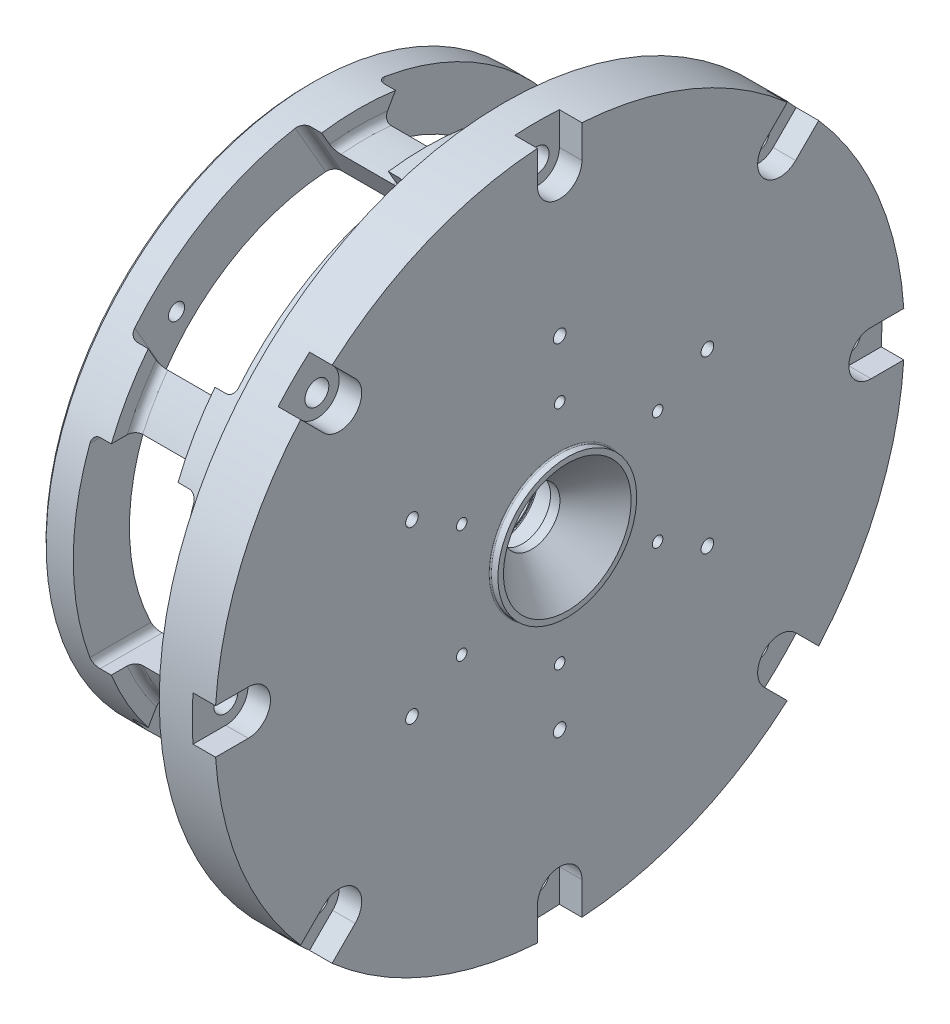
from build123d import *

# Parameters (mm, degrees)
WINDOWS_DEPTH                                   = 109.023865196
CIRPATTERN6_COUNT                               = 3
FILLET1_R                                       = 0.254
FILLET2_R                                       = 0.79375
CIRPATTERN1_COUNT                               = 4
CHAMFER1_SIZE                                   = 7.62
CIRPATTERN3_COUNT                               = 6
CIRPATTERN4_COUNT                               = 6
CHAMFER2_SIZE                                   = 0.7874
SKETCH23_W                                      = 1.8796
SKETCH23_H                                      = 3.4544
CBORE_FOR_10_SOCKET_HEAD_CAP_SCREW1_D           = 5.1054
CBORE_FOR_10_SOCKET_HEAD_CAP_SCREW1_CBORE_D     = 9.525
CBORE_FOR_10_SOCKET_HEAD_CAP_SCREW1_CBORE_DEPTH = 4.826
CUT_EXTRUDE1_DEPTH                              = 4.826
CIRPATTERN5_COUNT                               = 8
CHAMFER3_SIZE                                   = 0.79375


with BuildPart() as part:
    # Sketch1 → Revolve1 (revolve)
    with BuildSketch(Plane.XY, mode=Mode.PRIVATE) as revolve1_sk:
        Polygon((-27.49375, 45.085), (-27.49375, 57.1119), (14.22575, 57.1119), (14.22575, 73.81875), (26.132, 73.81875), (26.132, 14.859), (27.7622, 14.859), (27.7622, 6.05), (18.131, 6.05), (18.131, 8.50011), (11.4, 8.50011), (11.4, 45.085), align=None)
    revolve(revolve1_sk.sketch.rotate(Axis((0, 0, 0), (1, 0, 0)), 90), axis=Axis((0, 0, 0), (1, 0, 0)))

    # Sketch7 → Groove for AS 568-244_ O-Ring1 (revolve, cut)
    with BuildSketch(Plane(origin=(0, 0, 0), x_dir=(0, 1, 0), z_dir=(0, 0, 1))):
        with BuildLine():
            Line((54.562462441, -3.905764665), (57.1119, -3.68271778))
            Line((57.1119, -3.68271778), (57.1119, -8.91283222))
            Line((57.1119, -8.91283222), (54.562462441, -8.689785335))
            ThreePointArc((54.562462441, -8.689785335), (54.397331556, -8.608351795), (54.3306, -8.436751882))
            Line((54.3306, -8.436751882), (54.3306, -4.158798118))
            ThreePointArc((54.3306, -4.158798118), (54.397331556, -3.987198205), (54.562462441, -3.905764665))
        make_face()
    revolve(axis=Axis((-50, 0, 0), (1, 0, 0)), mode=Mode.SUBTRACT)

    # Sketch27 → Windows (cut, symmetric)
    with BuildSketch(Plane.XY):
        with BuildLine():
            Line((-19.30225, 21.43125), (-0.25225, 21.43125))
            ThreePointArc((-0.25225, 21.43125), (0.870282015, 20.966282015), (1.33525, 19.84375))
            Line((1.33525, 19.84375), (1.33525, -19.84375))
            ThreePointArc((1.33525, -19.84375), (0.870282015, -20.966282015), (-0.25225, -21.43125))
            Line((-0.25225, -21.43125), (-19.30225, -21.43125))
            ThreePointArc((-19.30225, -21.43125), (-20.424782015, -20.966282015), (-20.88975, -19.84375))
            Line((-20.88975, -19.84375), (-20.88975, 19.84375))
            ThreePointArc((-20.88975, 19.84375), (-20.424782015, 20.966282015), (-19.30225, 21.43125))
        make_face()
    windows = extrude(amount=WINDOWS_DEPTH, both=True, mode=Mode.SUBTRACT)

    # CirPattern6: Windows ×3 about axis
    cirpattern6_axis = Axis((0, 0, 0), (1, 0, 0))
    for i in range(1, CIRPATTERN6_COUNT):
        add(windows.rotate(cirpattern6_axis, i * 360 / CIRPATTERN6_COUNT), mode=Mode.SUBTRACT)

    # Sketch11 → Groove for Smalley VHM-17 (revolve, cut)
    with BuildSketch(Plane(origin=(0, 0, 0), x_dir=(0, 1, 0), z_dir=(0, 0, 1)), mode=Mode.PRIVATE) as groove_for_smalley_vhm_17_sk:
        with BuildLine():
            Line((8.76, -13.1056), (7.2, -13.1056))
            Line((7.2, -13.1056), (7.2, -12.5456))
            Line((7.2, -12.5456), (8.76, -12.5456))
            ThreePointArc((8.76, -12.5456), (8.830710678, -12.574889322), (8.86, -12.6456))
            Line((8.86, -12.6456), (8.86, -13.0056))
            ThreePointArc((8.86, -13.0056), (8.830710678, -13.076310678), (8.76, -13.1056))
        make_face()
    revolve(groove_for_smalley_vhm_17_sk.sketch.rotate(Axis((50, 0, 0), (-1, 0, 0)), 270), axis=Axis((50, 0, 0), (-1, 0, 0)), mode=Mode.SUBTRACT)

    # Fillet1
    fillet1_edges = [part.edges().sort_by_distance(p)[0] for p in [
        (18.131, 0, -8.50011),
        (26.132, 0, -14.859),
    ]]
    fillet(fillet1_edges, radius=FILLET1_R)

    # Fillet2
    fillet2_edges = [part.edges().sort_by_distance(p)[0] for p in [
        (11.4, 0, -45.085),
    ]]
    fillet(fillet2_edges, radius=FILLET2_R)

    # Sketch12 → 8-32 Tapped Hole1 (revolve, cut)
    with BuildSketch(Plane(origin=(-27.49375, 35.001805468, 35.001805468), x_dir=(0, 0, 1), z_dir=(0, 1, 0))):
        Polygon((0, 0), (0, 11.746446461), (1.7272, 10.70864), (1.7272, 0), align=None)
    f_8_32_tapped_hole1 = revolve(axis=Axis((-33.84375, 35.001805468, 35.001805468), (1, 0, 0)), mode=Mode.SUBTRACT)

    # CirPattern1: 8-32 Tapped Hole1 ×4 about axis
    cirpattern1_axis = Axis((0, 0, 0), (1, 0, 0))
    for i in range(1, CIRPATTERN1_COUNT):
        add(f_8_32_tapped_hole1.rotate(cirpattern1_axis, i * 360 / CIRPATTERN1_COUNT), mode=Mode.SUBTRACT)

    # Chamfer1
    chamfer1_edges = [part.edges().sort_by_distance(p)[0] for p in [
        (27.7622, 0, -6.05),
    ]]
    chamfer(chamfer1_edges, length=CHAMFER1_SIZE)

    # Sketch15 → 4-40 Tapped Hole2 (revolve, cut)
    with BuildSketch(Plane(origin=(26.132, 24.209375, 0), x_dir=(0, 0, -1), z_dir=(0, 1, 0))):
        Polygon((0, 0), (0, 8.273752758), (1.1303, 7.5946), (1.1303, 0), align=None)
    f_4_40_tapped_hole2 = revolve(axis=Axis((32.482, 24.209375, 0), (-1, 0, 0)), mode=Mode.SUBTRACT)

    # CirPattern3: 4-40 Tapped Hole2 ×6 about axis
    cirpattern3_axis = Axis((0, 0, 0), (1, 0, 0))
    for i in range(1, CIRPATTERN3_COUNT):
        add(f_4_40_tapped_hole2.rotate(cirpattern3_axis, i * 360 / CIRPATTERN3_COUNT), mode=Mode.SUBTRACT)

    # Sketch17 → 6-32 Tapped Hole1 (revolve, cut)
    with BuildSketch(Plane(origin=(26.132, 36.5125, 0), x_dir=(0, 0, -1), z_dir=(0, 1, 0))):
        Polygon((0, 0), (0, 8.43269403), (1.35255, 7.62), (1.35255, 0), align=None)
    f_6_32_tapped_hole1 = revolve(axis=Axis((32.482, 36.5125, 0), (-1, 0, 0)), mode=Mode.SUBTRACT)

    # CirPattern4: 6-32 Tapped Hole1 ×6 about axis
    cirpattern4_axis = Axis((0, 0, 0), (1, 0, 0))
    for i in range(1, CIRPATTERN4_COUNT):
        add(f_6_32_tapped_hole1.rotate(cirpattern4_axis, i * 360 / CIRPATTERN4_COUNT), mode=Mode.SUBTRACT)

    # Chamfer2
    chamfer2_edges = [part.edges().sort_by_distance(p)[0] for p in [
        (-27.49375, 0, -57.1119),
    ]]
    chamfer(chamfer2_edges, length=CHAMFER2_SIZE)

    # Sketch23 → Cut-Revolve 2-157 (revolve, cut)
    with BuildSketch(Plane.XY):
        with Locations((15.16555, 60.9092)):
            Rectangle(SKETCH23_W, SKETCH23_H)
    revolve(axis=Axis((0, 0, 0), (-1, 0, 0)), mode=Mode.SUBTRACT)

    # CBORE for _10 Socket Head Cap Screw1 (through all)
    with Locations(Plane(origin=(26.132, 0, 0), x_dir=(0, 0, -1), z_dir=(1, 0, 0))):
        with Locations((0, 66.675)):
            cbore_for_10_socket_head_cap_screw1 = CounterBoreHole(CBORE_FOR_10_SOCKET_HEAD_CAP_SCREW1_D / 2, CBORE_FOR_10_SOCKET_HEAD_CAP_SCREW1_CBORE_D / 2, CBORE_FOR_10_SOCKET_HEAD_CAP_SCREW1_CBORE_DEPTH)

    # Sketch26 → Cut-Extrude1 (cut)
    with BuildSketch(Plane(origin=(26.132, 0, 0), x_dir=(0, 0, -1), z_dir=(1, 0, 0))):
        with BuildLine():
            Line((-4.7625, 66.675), (-4.7625, 87.321870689))
            Line((-4.7625, 87.321870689), (4.7625, 87.321870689))
            Line((4.7625, 87.321870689), (4.7625, 66.675))
            ThreePointArc((4.7625, 66.675), (0, 61.9125), (-4.7625, 66.675))
        make_face()
    cut_extrude1 = extrude(amount=-CUT_EXTRUDE1_DEPTH, mode=Mode.SUBTRACT)

    # CirPattern5: CBORE for _10 Socket Head Cap Screw1, Cut-Extrude1 ×8 about axis
    cirpattern5_axis = Axis((0, 0, 0), (1, 0, 0))
    add([cbore_for_10_socket_head_cap_screw1.rotate(cirpattern5_axis, i * 360 / CIRPATTERN5_COUNT) for i in range(1, CIRPATTERN5_COUNT)], mode=Mode.SUBTRACT)
    add([cut_extrude1.rotate(cirpattern5_axis, i * 360 / CIRPATTERN5_COUNT) for i in range(1, CIRPATTERN5_COUNT)], mode=Mode.SUBTRACT)

    # Chamfer3
    chamfer3_edges = [part.edges().sort_by_distance(p)[0] for p in [
        (-27.49375, 0, -45.085),
    ]]
    chamfer(chamfer3_edges, length=CHAMFER3_SIZE)

    # Sketch28 → Relief Cut-Revolve1 (revolve, cut)
    with BuildSketch(Plane.XY, mode=Mode.PRIVATE) as relief_cut_revolve1_sk:
        with BuildLine():
            Line((-16.921, 57.1119), (-2.6335, 57.1119))
            Line((-2.6335, 57.1119), (-2.6335, 53.975))
            ThreePointArc((-2.6335, 53.975), (-3.098467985, 52.852467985), (-4.221, 52.3875))
            Line((-4.221, 52.3875), (-15.3335, 52.3875))
            ThreePointArc((-15.3335, 52.3875), (-16.456032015, 52.852467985), (-16.921, 53.975))
            Line((-16.921, 53.975), (-16.921, 57.1119))
        make_face()
    revolve(relief_cut_revolve1_sk.sketch.rotate(Axis((0, 0, 0), (-1, 0, 0)), 90), axis=Axis((0, 0, 0), (-1, 0, 0)), mode=Mode.SUBTRACT)


solid = part.part
